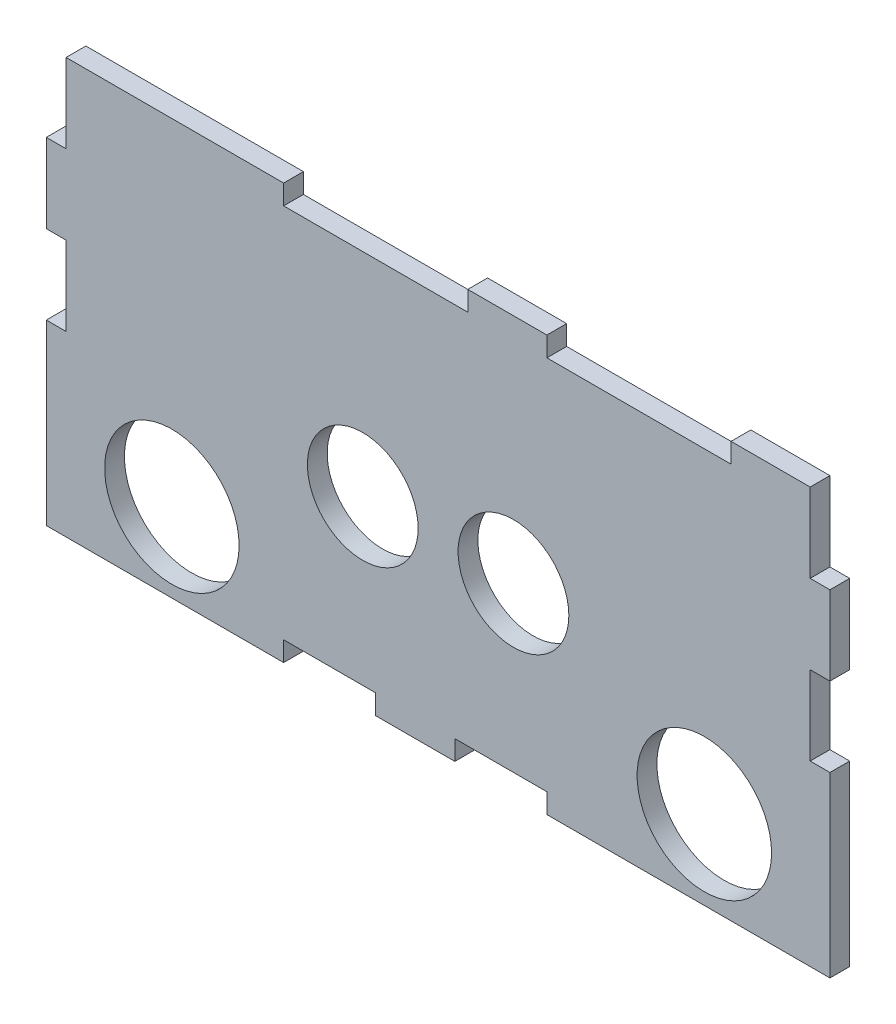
from build123d import *

# Parameters (mm, degrees)
SKETCH1_R           = 17
SKETCH1_R_2         = 14
BOSS_EXTRUDE1_DEPTH = 5


with BuildPart() as part:
    # Sketch1 → Boss-Extrude1 (new body)
    with BuildSketch(Plane.XY):
        Polygon((0, 0), (0, 45), (5, 45), (5, 65), (0, 65), (0, 85), (5, 85), (5, 105), (60, 105), (60, 100), (106.56, 100), (106.56, 105), (126.56, 105), (126.56, 100), (173.12, 100), (173.12, 105), (193.12, 105), (193.12, 85), (198.12, 85), (198.12, 65), (193.12, 65), (193.12, 45), (198.12, 45), (198.12, 0), (126.56, 0), (126.56, 5), (103.28, 5), (103.28, 0), (83.28, 0), (83.28, 5), (60, 5), (60, 0), align=None)
        with Locations((31.75, 20)):
            Circle(SKETCH1_R, mode=Mode.SUBTRACT)
        with Locations((80.01, 46.381288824)):
            Circle(SKETCH1_R_2, mode=Mode.SUBTRACT)
        with Locations((118.11, 46.381288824)):
            Circle(SKETCH1_R_2, mode=Mode.SUBTRACT)
        with Locations((166.37, 20)):
            Circle(SKETCH1_R, mode=Mode.SUBTRACT)
    extrude(amount=BOSS_EXTRUDE1_DEPTH)


solid = part.part
